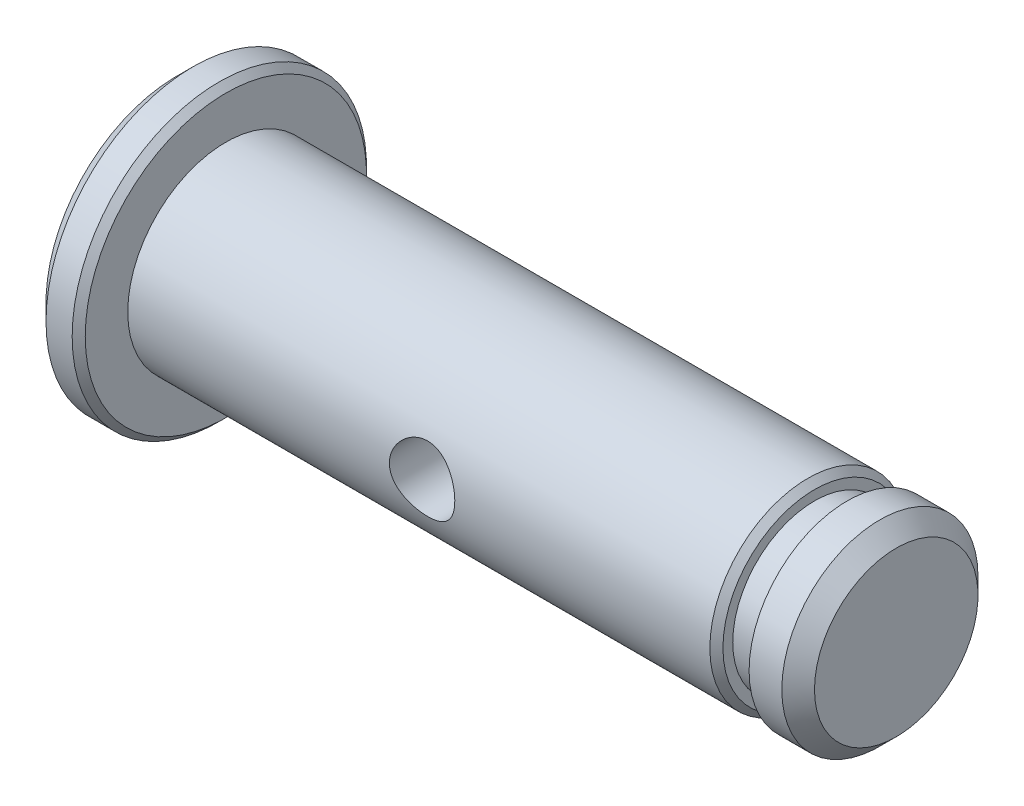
from build123d import *

# Parameters (mm, degrees)
CHAMFER_1_SIZE      = 0.5
SKETCH_2_R          = 1
CUT_EXTRUDE_1_DEPTH = 15
CHAMFER_2_SIZE      = 0.2


with BuildPart() as part:
    # Sketch 1 → Revolve 1 (revolve)
    with BuildSketch(Plane.XY, mode=Mode.PRIVATE) as revolve_1_sk:
        Polygon((0, 0), (0, 4.5), (1.5, 4.5), (1.5, 3), (19.5, 3), (19.5, 2.5), (20.5, 2.5), (20.5, 3), (22, 3), (22, 0), align=None)
    revolve(revolve_1_sk.sketch.rotate(Axis((0, 0, 0), (1, 0, 0)), 90), axis=Axis((0, 0, 0), (1, 0, 0)))

    # Chamfer 1
    chamfer_1_edges = [part.edges().sort_by_distance(p)[0] for p in [
        (0, 0, -4.5),
        (22, 0, -3),
    ]]
    chamfer(chamfer_1_edges, length=CHAMFER_1_SIZE)

    # Sketch 2 → Cut-Extrude 1 (cut, symmetric)
    with BuildSketch(Plane.XY):
        with Locations((10.5, 0)):
            Circle(SKETCH_2_R)
    extrude(amount=CUT_EXTRUDE_1_DEPTH, both=True, mode=Mode.SUBTRACT)

    # Chamfer 2
    chamfer_2_edges = [part.edges().sort_by_distance(p)[0] for p in [
        (1.5, 0, -4.5),
        (19.5, 0, -3),
    ]]
    chamfer(chamfer_2_edges, length=CHAMFER_2_SIZE)


solid = part.part
